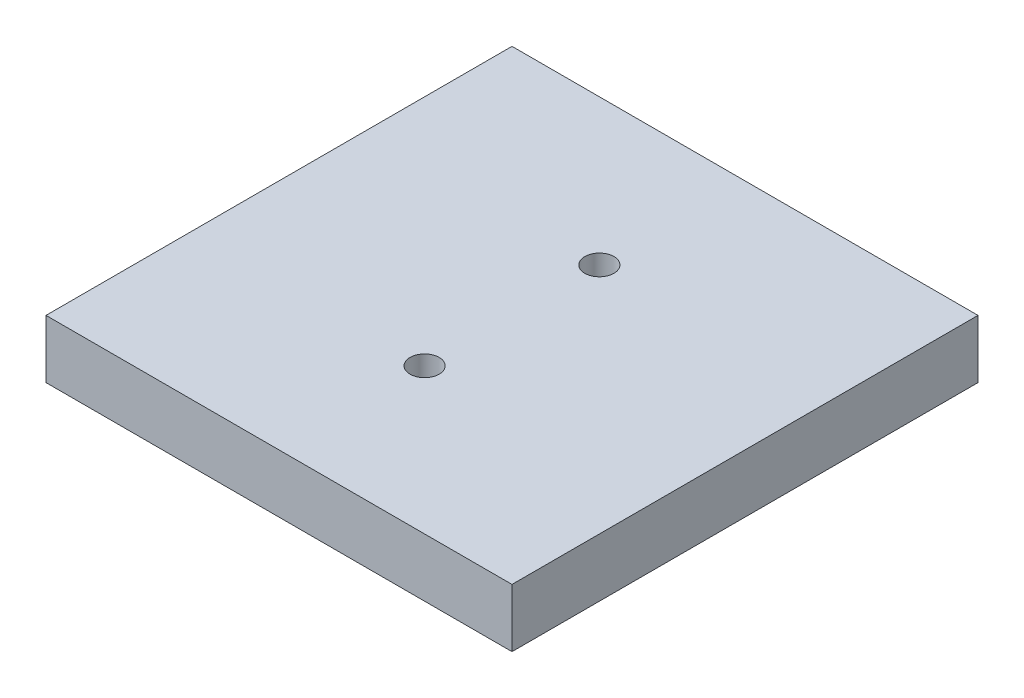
ISO-10303-21;
HEADER;
FILE_DESCRIPTION(('STEP AP214'),'2;1');
FILE_NAME('part.step','',(''),(''),'','','');
FILE_SCHEMA(('AUTOMOTIVE_DESIGN { 1 0 10303 214 1 1 1 1 }'));
ENDSEC;
DATA;
#1=APPLICATION_CONTEXT('core data for automotive mechanical design processes');
#2=APPLICATION_PROTOCOL_DEFINITION('international standard','automotive_design',2000,#1);
#3=PRODUCT_CONTEXT('',#1,'mechanical');
#4=PRODUCT('Part','Part','',(#3));
#5=PRODUCT_RELATED_PRODUCT_CATEGORY('part','',(#4));
#6=PRODUCT_DEFINITION_FORMATION('','',#4);
#7=PRODUCT_DEFINITION_CONTEXT('part definition',#1,'design');
#8=PRODUCT_DEFINITION('design','',#6,#7);
#9=PRODUCT_DEFINITION_SHAPE('','',#8);
#10=(LENGTH_UNIT() NAMED_UNIT(*) SI_UNIT(.MILLI.,.METRE.));
#11=(NAMED_UNIT(*) PLANE_ANGLE_UNIT() SI_UNIT($,.RADIAN.));
#12=(NAMED_UNIT(*) SI_UNIT($,.STERADIAN.) SOLID_ANGLE_UNIT());
#13=UNCERTAINTY_MEASURE_WITH_UNIT(LENGTH_MEASURE(1.E-05),#10,'distance_accuracy_value','');
#14=(GEOMETRIC_REPRESENTATION_CONTEXT(3) GLOBAL_UNCERTAINTY_ASSIGNED_CONTEXT((#13)) GLOBAL_UNIT_ASSIGNED_CONTEXT((#10,
#11,#12)) REPRESENTATION_CONTEXT('',''));
#15=CARTESIAN_POINT('',(0.,0.,0.));
#16=DIRECTION('',(0.,0.,1.));
#17=DIRECTION('',(1.,0.,0.));
#18=AXIS2_PLACEMENT_3D('',#15,#16,#17);
#19=CARTESIAN_POINT('',(0.,10.,79.9999999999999));
#20=DIRECTION('',(0.,-1.,0.));
#21=DIRECTION('',(0.,0.,-0.999999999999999));
#22=AXIS2_PLACEMENT_3D('',#19,#20,#21);
#23=PLANE('',#22);
#24=CARTESIAN_POINT('',(40.,10.,25.));
#25=DIRECTION('',(0.,1.,0.));
#26=DIRECTION('',(0.,0.,0.999999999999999));
#27=AXIS2_PLACEMENT_3D('',#24,#25,#26);
#28=CIRCLE('',#27,2.49999999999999);
#29=CARTESIAN_POINT('',(40.,10.,27.5));
#30=VERTEX_POINT('',#29);
#31=EDGE_CURVE('E145',#30,#30,#28,.T.);
#32=ORIENTED_EDGE('',*,*,#31,.F.);
#33=EDGE_LOOP('',(#32));
#34=FACE_BOUND('',#33,.T.);
#35=DIRECTION('',(-1.,0.,0.));
#36=VECTOR('',#35,1.);
#37=CARTESIAN_POINT('',(0.,10.,0.));
#38=LINE('',#37,#36);
#39=CARTESIAN_POINT('',(80.0000000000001,10.,0.));
#40=VERTEX_POINT('',#39);
#41=CARTESIAN_POINT('',(0.,10.,0.));
#42=VERTEX_POINT('',#41);
#43=EDGE_CURVE('E98',#40,#42,#38,.T.);
#44=ORIENTED_EDGE('',*,*,#43,.T.);
#45=DIRECTION('',(0.,0.,-0.999999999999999));
#46=VECTOR('',#45,1.);
#47=CARTESIAN_POINT('',(0.,10.,79.9999999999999));
#48=LINE('',#47,#46);
#49=CARTESIAN_POINT('',(0.,10.,79.9999999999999));
#50=VERTEX_POINT('',#49);
#51=EDGE_CURVE('E89',#50,#42,#48,.T.);
#52=ORIENTED_EDGE('',*,*,#51,.F.);
#53=DIRECTION('',(-1.,0.,0.));
#54=VECTOR('',#53,1.);
#55=CARTESIAN_POINT('',(0.,10.,79.9999999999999));
#56=LINE('',#55,#54);
#57=CARTESIAN_POINT('',(80.0000000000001,10.,80.));
#58=VERTEX_POINT('',#57);
#59=EDGE_CURVE('E47',#58,#50,#56,.T.);
#60=ORIENTED_EDGE('',*,*,#59,.F.);
#61=DIRECTION('',(0.,0.,-0.999999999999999));
#62=VECTOR('',#61,1.);
#63=CARTESIAN_POINT('',(80.0000000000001,10.,80.));
#64=LINE('',#63,#62);
#65=EDGE_CURVE('E106',#58,#40,#64,.T.);
#66=ORIENTED_EDGE('',*,*,#65,.T.);
#67=EDGE_LOOP('',(#44,#52,#60,#66));
#68=FACE_BOUND('',#67,.T.);
#69=CARTESIAN_POINT('',(40.,10.,55.));
#70=DIRECTION('',(0.,1.,0.));
#71=DIRECTION('',(0.,0.,0.999999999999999));
#72=AXIS2_PLACEMENT_3D('',#69,#70,#71);
#73=CIRCLE('',#72,2.49999999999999);
#74=CARTESIAN_POINT('',(40.,10.,57.5));
#75=VERTEX_POINT('',#74);
#76=EDGE_CURVE('E93',#75,#75,#73,.T.);
#77=ORIENTED_EDGE('',*,*,#76,.F.);
#78=EDGE_LOOP('',(#77));
#79=FACE_BOUND('',#78,.T.);
#80=ADVANCED_FACE('F32',(#34,#68,#79),#23,.F.);
#81=CARTESIAN_POINT('',(0.,0.,79.9999999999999));
#82=DIRECTION('',(1.,0.,0.));
#83=DIRECTION('',(0.,0.,-0.999999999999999));
#84=AXIS2_PLACEMENT_3D('',#81,#82,#83);
#85=PLANE('',#84);
#86=DIRECTION('',(0.,-1.,0.));
#87=VECTOR('',#86,1.);
#88=CARTESIAN_POINT('',(0.,0.,0.));
#89=LINE('',#88,#87);
#90=CARTESIAN_POINT('',(0.,0.,0.));
#91=VERTEX_POINT('',#90);
#92=EDGE_CURVE('E77',#42,#91,#89,.T.);
#93=ORIENTED_EDGE('',*,*,#92,.T.);
#94=DIRECTION('',(0.,0.,-0.999999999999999));
#95=VECTOR('',#94,1.);
#96=CARTESIAN_POINT('',(0.,0.,79.9999999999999));
#97=LINE('',#96,#95);
#98=CARTESIAN_POINT('',(0.,0.,79.9999999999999));
#99=VERTEX_POINT('',#98);
#100=EDGE_CURVE('E11',#99,#91,#97,.T.);
#101=ORIENTED_EDGE('',*,*,#100,.F.);
#102=DIRECTION('',(0.,-1.,0.));
#103=VECTOR('',#102,1.);
#104=CARTESIAN_POINT('',(0.,0.,79.9999999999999));
#105=LINE('',#104,#103);
#106=EDGE_CURVE('E100',#50,#99,#105,.T.);
#107=ORIENTED_EDGE('',*,*,#106,.F.);
#108=ORIENTED_EDGE('',*,*,#51,.T.);
#109=EDGE_LOOP('',(#93,#101,#107,#108));
#110=FACE_BOUND('',#109,.T.);
#111=ADVANCED_FACE('F34',(#110),#85,.F.);
#112=CARTESIAN_POINT('',(0.,0.,79.9999999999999));
#113=DIRECTION('',(0.,1.,0.));
#114=DIRECTION('',(0.,0.,0.999999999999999));
#115=AXIS2_PLACEMENT_3D('',#112,#113,#114);
#116=PLANE('',#115);
#117=CARTESIAN_POINT('',(40.,0.,25.));
#118=DIRECTION('',(0.,1.,0.));
#119=DIRECTION('',(0.,0.,0.999999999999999));
#120=AXIS2_PLACEMENT_3D('',#117,#118,#119);
#121=CIRCLE('',#120,2.49999999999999);
#122=CARTESIAN_POINT('',(40.,0.,27.5));
#123=VERTEX_POINT('',#122);
#124=EDGE_CURVE('E136',#123,#123,#121,.T.);
#125=ORIENTED_EDGE('',*,*,#124,.T.);
#126=EDGE_LOOP('',(#125));
#127=FACE_BOUND('',#126,.T.);
#128=CARTESIAN_POINT('',(40.,0.,55.));
#129=DIRECTION('',(0.,1.,0.));
#130=DIRECTION('',(0.,0.,0.999999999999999));
#131=AXIS2_PLACEMENT_3D('',#128,#129,#130);
#132=CIRCLE('',#131,2.49999999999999);
#133=CARTESIAN_POINT('',(40.,0.,57.5));
#134=VERTEX_POINT('',#133);
#135=EDGE_CURVE('E90',#134,#134,#132,.T.);
#136=ORIENTED_EDGE('',*,*,#135,.T.);
#137=EDGE_LOOP('',(#136));
#138=FACE_BOUND('',#137,.T.);
#139=DIRECTION('',(1.,0.,0.));
#140=VECTOR('',#139,1.);
#141=CARTESIAN_POINT('',(0.,0.,0.));
#142=LINE('',#141,#140);
#143=CARTESIAN_POINT('',(80.0000000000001,0.,0.));
#144=VERTEX_POINT('',#143);
#145=EDGE_CURVE('E73',#91,#144,#142,.T.);
#146=ORIENTED_EDGE('',*,*,#145,.T.);
#147=DIRECTION('',(0.,0.,-0.999999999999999));
#148=VECTOR('',#147,1.);
#149=CARTESIAN_POINT('',(80.0000000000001,0.,80.));
#150=LINE('',#149,#148);
#151=CARTESIAN_POINT('',(80.0000000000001,0.,80.));
#152=VERTEX_POINT('',#151);
#153=EDGE_CURVE('E40',#152,#144,#150,.T.);
#154=ORIENTED_EDGE('',*,*,#153,.F.);
#155=DIRECTION('',(1.,0.,0.));
#156=VECTOR('',#155,1.);
#157=CARTESIAN_POINT('',(0.,0.,79.9999999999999));
#158=LINE('',#157,#156);
#159=EDGE_CURVE('E85',#99,#152,#158,.T.);
#160=ORIENTED_EDGE('',*,*,#159,.F.);
#161=ORIENTED_EDGE('',*,*,#100,.T.);
#162=EDGE_LOOP('',(#146,#154,#160,#161));
#163=FACE_BOUND('',#162,.T.);
#164=ADVANCED_FACE('F84',(#127,#138,#163),#116,.F.);
#165=CARTESIAN_POINT('',(80.0000000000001,0.,80.));
#166=DIRECTION('',(-1.,0.,0.));
#167=DIRECTION('',(0.,0.,0.999999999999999));
#168=AXIS2_PLACEMENT_3D('',#165,#166,#167);
#169=PLANE('',#168);
#170=DIRECTION('',(0.,1.,0.));
#171=VECTOR('',#170,1.);
#172=CARTESIAN_POINT('',(80.0000000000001,0.,0.));
#173=LINE('',#172,#171);
#174=EDGE_CURVE('E78',#144,#40,#173,.T.);
#175=ORIENTED_EDGE('',*,*,#174,.T.);
#176=ORIENTED_EDGE('',*,*,#65,.F.);
#177=DIRECTION('',(0.,1.,0.));
#178=VECTOR('',#177,1.);
#179=CARTESIAN_POINT('',(80.0000000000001,0.,80.));
#180=LINE('',#179,#178);
#181=EDGE_CURVE('E52',#152,#58,#180,.T.);
#182=ORIENTED_EDGE('',*,*,#181,.F.);
#183=ORIENTED_EDGE('',*,*,#153,.T.);
#184=EDGE_LOOP('',(#175,#176,#182,#183));
#185=FACE_BOUND('',#184,.T.);
#186=ADVANCED_FACE('F109',(#185),#169,.F.);
#187=CARTESIAN_POINT('',(0.,10.,79.9999999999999));
#188=DIRECTION('',(0.,0.,-0.999999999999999));
#189=DIRECTION('',(-1.,0.,0.));
#190=AXIS2_PLACEMENT_3D('',#187,#188,#189);
#191=PLANE('',#190);
#192=ORIENTED_EDGE('',*,*,#106,.T.);
#193=ORIENTED_EDGE('',*,*,#159,.T.);
#194=ORIENTED_EDGE('',*,*,#181,.T.);
#195=ORIENTED_EDGE('',*,*,#59,.T.);
#196=EDGE_LOOP('',(#192,#193,#194,#195));
#197=FACE_BOUND('',#196,.T.);
#198=ADVANCED_FACE('F112',(#197),#191,.F.);
#199=CARTESIAN_POINT('',(0.,10.,0.));
#200=DIRECTION('',(0.,0.,-0.999999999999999));
#201=DIRECTION('',(-1.,0.,0.));
#202=AXIS2_PLACEMENT_3D('',#199,#200,#201);
#203=PLANE('',#202);
#204=ORIENTED_EDGE('',*,*,#92,.F.);
#205=ORIENTED_EDGE('',*,*,#43,.F.);
#206=ORIENTED_EDGE('',*,*,#174,.F.);
#207=ORIENTED_EDGE('',*,*,#145,.F.);
#208=EDGE_LOOP('',(#204,#205,#206,#207));
#209=FACE_BOUND('',#208,.T.);
#210=ADVANCED_FACE('F74',(#209),#203,.T.);
#211=CARTESIAN_POINT('',(40.,10.,55.));
#212=DIRECTION('',(0.,1.,0.));
#213=DIRECTION('',(0.,0.,0.999999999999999));
#214=AXIS2_PLACEMENT_3D('',#211,#212,#213);
#215=CYLINDRICAL_SURFACE('',#214,2.49999999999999);
#216=ORIENTED_EDGE('',*,*,#135,.F.);
#217=EDGE_LOOP('',(#216));
#218=FACE_BOUND('',#217,.T.);
#219=ORIENTED_EDGE('',*,*,#76,.T.);
#220=EDGE_LOOP('',(#219));
#221=FACE_BOUND('',#220,.T.);
#222=ADVANCED_FACE('F119',(#218,#221),#215,.F.);
#223=CARTESIAN_POINT('',(40.,10.,25.));
#224=DIRECTION('',(0.,1.,0.));
#225=DIRECTION('',(0.,0.,0.999999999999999));
#226=AXIS2_PLACEMENT_3D('',#223,#224,#225);
#227=CYLINDRICAL_SURFACE('',#226,2.49999999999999);
#228=ORIENTED_EDGE('',*,*,#124,.F.);
#229=EDGE_LOOP('',(#228));
#230=FACE_BOUND('',#229,.T.);
#231=ORIENTED_EDGE('',*,*,#31,.T.);
#232=EDGE_LOOP('',(#231));
#233=FACE_BOUND('',#232,.T.);
#234=ADVANCED_FACE('F141',(#230,#233),#227,.F.);
#235=CLOSED_SHELL('',(#80,#111,#164,#186,#198,#210,#222,#234));
#236=MANIFOLD_SOLID_BREP('B2',#235);
#237=ADVANCED_BREP_SHAPE_REPRESENTATION('',(#18,#236),#14);
#238=SHAPE_DEFINITION_REPRESENTATION(#9,#237);
ENDSEC;
END-ISO-10303-21;
